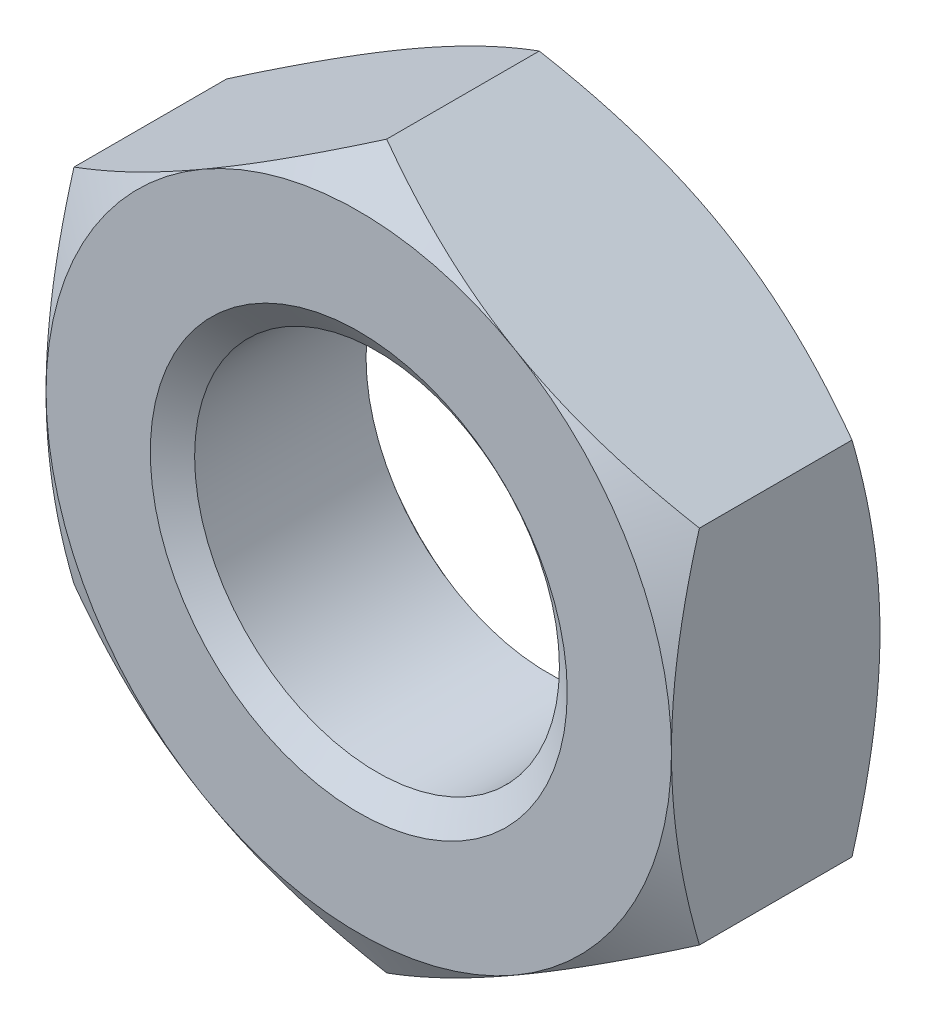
ISO-10303-21;
HEADER;
FILE_DESCRIPTION(('STEP AP214'),'2;1');
FILE_NAME('part.step','',(''),(''),'','','');
FILE_SCHEMA(('AUTOMOTIVE_DESIGN { 1 0 10303 214 1 1 1 1 }'));
ENDSEC;
DATA;
#1=APPLICATION_CONTEXT('core data for automotive mechanical design processes');
#2=APPLICATION_PROTOCOL_DEFINITION('international standard','automotive_design',2000,#1);
#3=PRODUCT_CONTEXT('',#1,'mechanical');
#4=PRODUCT('Part','Part','',(#3));
#5=PRODUCT_RELATED_PRODUCT_CATEGORY('part','',(#4));
#6=PRODUCT_DEFINITION_FORMATION('','',#4);
#7=PRODUCT_DEFINITION_CONTEXT('part definition',#1,'design');
#8=PRODUCT_DEFINITION('design','',#6,#7);
#9=PRODUCT_DEFINITION_SHAPE('','',#8);
#10=(LENGTH_UNIT() NAMED_UNIT(*) SI_UNIT(.MILLI.,.METRE.));
#11=(NAMED_UNIT(*) PLANE_ANGLE_UNIT() SI_UNIT($,.RADIAN.));
#12=(NAMED_UNIT(*) SI_UNIT($,.STERADIAN.) SOLID_ANGLE_UNIT());
#13=UNCERTAINTY_MEASURE_WITH_UNIT(LENGTH_MEASURE(1.E-05),#10,'distance_accuracy_value','');
#14=(GEOMETRIC_REPRESENTATION_CONTEXT(3) GLOBAL_UNCERTAINTY_ASSIGNED_CONTEXT((#13)) GLOBAL_UNIT_ASSIGNED_CONTEXT((#10,
#11,#12)) REPRESENTATION_CONTEXT('',''));
#15=CARTESIAN_POINT('',(0.,0.,0.));
#16=DIRECTION('',(0.,0.,1.));
#17=DIRECTION('',(1.,0.,0.));
#18=AXIS2_PLACEMENT_3D('',#15,#16,#17);
#19=CARTESIAN_POINT('',(0.,0.,-10.));
#20=DIRECTION('',(0.,0.,1.));
#21=DIRECTION('',(1.,0.,0.));
#22=AXIS2_PLACEMENT_3D('',#19,#20,#21);
#23=CYLINDRICAL_SURFACE('',#22,8.75);
#24=CARTESIAN_POINT('',(0.,0.,-0.875259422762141));
#25=DIRECTION('',(0.,0.,1.));
#26=DIRECTION('',(1.,0.,0.));
#27=AXIS2_PLACEMENT_3D('',#24,#25,#26);
#28=CIRCLE('',#27,8.75);
#29=CARTESIAN_POINT('',(8.75,0.,-0.875259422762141));
#30=VERTEX_POINT('',#29);
#31=EDGE_CURVE('E174',#30,#30,#28,.F.);
#32=ORIENTED_EDGE('',*,*,#31,.F.);
#33=EDGE_LOOP('',(#32));
#34=FACE_BOUND('',#33,.T.);
#35=CARTESIAN_POINT('',(0.,0.,-9.09934057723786));
#36=DIRECTION('',(0.,0.,-1.));
#37=DIRECTION('',(-1.,0.,0.));
#38=AXIS2_PLACEMENT_3D('',#35,#36,#37);
#39=CIRCLE('',#38,8.75);
#40=CARTESIAN_POINT('',(-8.75,0.,-9.09934057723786));
#41=VERTEX_POINT('',#40);
#42=EDGE_CURVE('E39',#41,#41,#39,.F.);
#43=ORIENTED_EDGE('',*,*,#42,.F.);
#44=EDGE_LOOP('',(#43));
#45=FACE_BOUND('',#44,.T.);
#46=ADVANCED_FACE('F34',(#34,#45),#23,.F.);
#47=CARTESIAN_POINT('',(0.,17.3205080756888,-10.));
#48=DIRECTION('',(-0.500000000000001,0.866025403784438,0.));
#49=DIRECTION('',(-0.866025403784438,-0.500000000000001,0.));
#50=AXIS2_PLACEMENT_3D('',#47,#48,#49);
#51=PLANE('',#50);
#52=DIRECTION('',(0.,0.,1.));
#53=VECTOR('',#52,1.);
#54=CARTESIAN_POINT('',(-15.,8.66025403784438,-10.));
#55=LINE('',#54,#53);
#56=CARTESIAN_POINT('',(-15.,8.66025403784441,-8.66025403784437));
#57=VERTEX_POINT('',#56);
#58=CARTESIAN_POINT('',(-15.,8.66025403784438,-1.33974596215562));
#59=VERTEX_POINT('',#58);
#60=EDGE_CURVE('E164',#57,#59,#55,.T.);
#61=ORIENTED_EDGE('',*,*,#60,.T.);
#62=CARTESIAN_POINT('',(-15.0002,8.66013856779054,-1.33981262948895));
#63=CARTESIAN_POINT('',(-14.6705058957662,8.85048754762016,-1.22992178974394));
#64=CARTESIAN_POINT('',(-14.3395258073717,9.04157899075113,-1.12501758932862));
#65=CARTESIAN_POINT('',(-13.674911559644,9.42529420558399,-0.926568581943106));
#66=CARTESIAN_POINT('',(-13.3412765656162,9.61791845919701,-0.833027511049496));
#67=CARTESIAN_POINT('',(-12.6707077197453,10.0050715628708,-0.658562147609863));
#68=CARTESIAN_POINT('',(-12.333767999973,10.199603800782,-0.577667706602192));
#69=CARTESIAN_POINT('',(-11.6575472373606,10.5900200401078,-0.430232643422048));
#70=CARTESIAN_POINT('',(-11.3182663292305,10.7859039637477,-0.363691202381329));
#71=CARTESIAN_POINT('',(-10.6460568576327,11.1740042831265,-0.24779237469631));
#72=CARTESIAN_POINT('',(-10.3131781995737,11.3661918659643,-0.198051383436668));
#73=CARTESIAN_POINT('',(-9.6458955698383,11.7514476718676,-0.11464674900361));
#74=CARTESIAN_POINT('',(-9.3114915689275,11.9445159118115,-0.0809834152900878));
#75=CARTESIAN_POINT('',(-8.64212181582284,12.3309767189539,-0.0305840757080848));
#76=CARTESIAN_POINT('',(-8.30715720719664,12.5243686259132,-0.0138279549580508));
#77=CARTESIAN_POINT('',(-7.63691878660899,12.9113309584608,0.00239660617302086));
#78=CARTESIAN_POINT('',(-7.30164498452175,13.1049013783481,0.00186558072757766));
#79=CARTESIAN_POINT('',(-6.67485311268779,13.4667798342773,-0.01527661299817));
#80=CARTESIAN_POINT('',(-6.38329037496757,13.6351136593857,-0.0297968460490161));
#81=CARTESIAN_POINT('',(-5.80083556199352,13.9713941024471,-0.0716371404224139));
#82=CARTESIAN_POINT('',(-5.50994353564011,14.1393406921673,-0.0989581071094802));
#83=CARTESIAN_POINT('',(-4.92898814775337,14.4747554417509,-0.16592351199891));
#84=CARTESIAN_POINT('',(-4.63892567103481,14.6422230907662,-0.205578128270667));
#85=CARTESIAN_POINT('',(-4.06016058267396,14.9763732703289,-0.29651510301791));
#86=CARTESIAN_POINT('',(-3.77145806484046,15.1430557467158,-0.347798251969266));
#87=CARTESIAN_POINT('',(-2.89508556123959,15.6490296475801,-0.520386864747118));
#88=CARTESIAN_POINT('',(-2.30995340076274,15.9868558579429,-0.658901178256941));
#89=CARTESIAN_POINT('',(-1.14841408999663,16.6574708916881,-0.973271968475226));
#90=CARTESIAN_POINT('',(-0.57199206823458,16.9902683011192,-1.14905461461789));
#91=CARTESIAN_POINT('',(0.000200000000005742,17.3206235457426,-1.33981262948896));
#92=B_SPLINE_CURVE_WITH_KNOTS('',3,(#62,#63,#64,#65,#66,#67,#68,#69,#70,#71,#72,#73,#74,#75,#76,
#77,#78,#79,#80,#81,#82,#83,#84,#85,#86,#87,#88,#89,#90,#91),.UNSPECIFIED.,.F.,.F.,(4,2,2,2,2,2,
2,2,2,2,2,2,2,2,4),(0.,1.18875411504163,2.37789802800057,3.56980778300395,4.76164951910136,
5.92407379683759,7.08652044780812,8.24758247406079,9.40860862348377,10.4193068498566,
11.4300765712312,12.4416826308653,13.4533574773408,15.5211962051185,17.5849760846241),.UNSPECIFIED.);
#93=CARTESIAN_POINT('',(-7.50000000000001,12.9903810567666,0.));
#94=VERTEX_POINT('',#93);
#95=EDGE_CURVE('E133',#59,#94,#92,.T.);
#96=ORIENTED_EDGE('',*,*,#95,.T.);
#97=CARTESIAN_POINT('',(0.,17.3205080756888,-1.33974596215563));
#98=VERTEX_POINT('',#97);
#99=EDGE_CURVE('E53',#94,#98,#92,.T.);
#100=ORIENTED_EDGE('',*,*,#99,.T.);
#101=DIRECTION('',(0.,0.,1.));
#102=VECTOR('',#101,1.);
#103=CARTESIAN_POINT('',(0.,17.3205080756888,-10.));
#104=LINE('',#103,#102);
#105=CARTESIAN_POINT('',(0.,17.3205080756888,-8.66025403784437));
#106=VERTEX_POINT('',#105);
#107=EDGE_CURVE('E149',#106,#98,#104,.T.);
#108=ORIENTED_EDGE('',*,*,#107,.F.);
#109=CARTESIAN_POINT('',(-15.0002,8.66013856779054,-8.66018737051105));
#110=CARTESIAN_POINT('',(-14.6705058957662,8.85048754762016,-8.77007821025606));
#111=CARTESIAN_POINT('',(-14.3395258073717,9.04157899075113,-8.87498241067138));
#112=CARTESIAN_POINT('',(-13.674911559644,9.42529420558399,-9.07343141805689));
#113=CARTESIAN_POINT('',(-13.3412765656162,9.61791845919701,-9.1669724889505));
#114=CARTESIAN_POINT('',(-12.6707077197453,10.0050715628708,-9.34143785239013));
#115=CARTESIAN_POINT('',(-12.333767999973,10.199603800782,-9.42233229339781));
#116=CARTESIAN_POINT('',(-11.6575472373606,10.5900200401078,-9.56976735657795));
#117=CARTESIAN_POINT('',(-11.3182663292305,10.7859039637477,-9.63630879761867));
#118=CARTESIAN_POINT('',(-10.6460568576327,11.1740042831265,-9.75220762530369));
#119=CARTESIAN_POINT('',(-10.3131781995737,11.3661918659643,-9.80194861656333));
#120=CARTESIAN_POINT('',(-9.6458955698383,11.7514476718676,-9.88535325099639));
#121=CARTESIAN_POINT('',(-9.3114915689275,11.9445159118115,-9.91901658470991));
#122=CARTESIAN_POINT('',(-8.64212181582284,12.3309767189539,-9.96941592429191));
#123=CARTESIAN_POINT('',(-8.30715720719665,12.5243686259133,-9.98617204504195));
#124=CARTESIAN_POINT('',(-7.63691878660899,12.9113309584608,-10.002396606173));
#125=CARTESIAN_POINT('',(-7.30164498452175,13.1049013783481,-10.0018655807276));
#126=CARTESIAN_POINT('',(-6.67485311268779,13.4667798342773,-9.98472338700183));
#127=CARTESIAN_POINT('',(-6.38329037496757,13.6351136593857,-9.97020315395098));
#128=CARTESIAN_POINT('',(-5.80083556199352,13.9713941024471,-9.92836285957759));
#129=CARTESIAN_POINT('',(-5.50994353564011,14.1393406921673,-9.90104189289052));
#130=CARTESIAN_POINT('',(-4.92898814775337,14.4747554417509,-9.83407648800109));
#131=CARTESIAN_POINT('',(-4.63892567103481,14.6422230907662,-9.79442187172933));
#132=CARTESIAN_POINT('',(-4.06016058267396,14.9763732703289,-9.70348489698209));
#133=CARTESIAN_POINT('',(-3.77145806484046,15.1430557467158,-9.65220174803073));
#134=CARTESIAN_POINT('',(-2.89508556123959,15.6490296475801,-9.47961313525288));
#135=CARTESIAN_POINT('',(-2.30995340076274,15.9868558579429,-9.34109882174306));
#136=CARTESIAN_POINT('',(-1.14841408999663,16.6574708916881,-9.02672803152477));
#137=CARTESIAN_POINT('',(-0.571992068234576,16.9902683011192,-8.85094538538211));
#138=CARTESIAN_POINT('',(0.000200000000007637,17.3206235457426,-8.66018737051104));
#139=B_SPLINE_CURVE_WITH_KNOTS('',3,(#109,#110,#111,#112,#113,#114,#115,#116,#117,#118,#119,
#120,#121,#122,#123,#124,#125,#126,#127,#128,#129,#130,#131,#132,#133,#134,#135,#136,#137,#138),
.UNSPECIFIED.,.F.,.F.,(4,2,2,2,2,2,2,2,2,2,2,2,2,2,4),(0.,1.18875411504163,2.37789802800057,
3.56980778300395,4.76164951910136,5.92407379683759,7.08652044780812,8.24758247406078,
9.40860862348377,10.4193068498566,11.4300765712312,12.4416826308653,13.4533574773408,
15.5211962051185,17.5849760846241),.UNSPECIFIED.);
#140=CARTESIAN_POINT('',(-7.50000000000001,12.9903810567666,-10.));
#141=VERTEX_POINT('',#140);
#142=EDGE_CURVE('E167',#141,#106,#139,.T.);
#143=ORIENTED_EDGE('',*,*,#142,.F.);
#144=EDGE_CURVE('E266',#57,#141,#139,.T.);
#145=ORIENTED_EDGE('',*,*,#144,.F.);
#146=EDGE_LOOP('',(#61,#96,#100,#108,#143,#145));
#147=FACE_BOUND('',#146,.T.);
#148=ADVANCED_FACE('F36',(#147),#51,.T.);
#149=CARTESIAN_POINT('',(15.,8.66025403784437,-10.));
#150=DIRECTION('',(0.500000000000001,0.866025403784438,0.));
#151=DIRECTION('',(-0.866025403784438,0.500000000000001,0.));
#152=AXIS2_PLACEMENT_3D('',#149,#150,#151);
#153=PLANE('',#152);
#154=ORIENTED_EDGE('',*,*,#107,.T.);
#155=CARTESIAN_POINT('',(-0.000199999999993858,17.3206235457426,-1.33981262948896));
#156=CARTESIAN_POINT('',(0.329494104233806,17.130274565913,-1.22992178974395));
#157=CARTESIAN_POINT('',(0.660474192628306,16.939183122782,-1.12501758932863));
#158=CARTESIAN_POINT('',(1.32508844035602,16.5554679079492,-0.926568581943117));
#159=CARTESIAN_POINT('',(1.65872343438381,16.3628436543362,-0.833027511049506));
#160=CARTESIAN_POINT('',(2.32929228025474,15.9756905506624,-0.658562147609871));
#161=CARTESIAN_POINT('',(2.66623200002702,15.7811583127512,-0.577667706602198));
#162=CARTESIAN_POINT('',(3.34245276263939,15.3907420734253,-0.430232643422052));
#163=CARTESIAN_POINT('',(3.68173367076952,15.1948581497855,-0.363691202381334));
#164=CARTESIAN_POINT('',(4.35394314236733,14.8067578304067,-0.247792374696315));
#165=CARTESIAN_POINT('',(4.68682180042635,14.6145702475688,-0.198051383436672));
#166=CARTESIAN_POINT('',(5.35410443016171,14.2293144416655,-0.114646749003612));
#167=CARTESIAN_POINT('',(5.68850843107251,14.0362462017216,-0.0809834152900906));
#168=CARTESIAN_POINT('',(6.35787818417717,13.6497853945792,-0.030584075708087));
#169=CARTESIAN_POINT('',(6.69284279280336,13.4563934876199,-0.0138279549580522));
#170=CARTESIAN_POINT('',(7.36308121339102,13.0694311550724,0.00239660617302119));
#171=CARTESIAN_POINT('',(7.69835501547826,12.8758607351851,0.00186558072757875));
#172=CARTESIAN_POINT('',(8.32514688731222,12.5139822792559,-0.0152766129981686));
#173=CARTESIAN_POINT('',(8.61670962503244,12.3456484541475,-0.0297968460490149));
#174=CARTESIAN_POINT('',(9.19916443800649,12.0093680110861,-0.0716371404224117));
#175=CARTESIAN_POINT('',(9.4900564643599,11.8414214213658,-0.0989581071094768));
#176=CARTESIAN_POINT('',(10.0710118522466,11.5060066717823,-0.165923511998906));
#177=CARTESIAN_POINT('',(10.3610743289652,11.338539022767,-0.205578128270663));
#178=CARTESIAN_POINT('',(10.939839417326,11.0043888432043,-0.296515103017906));
#179=CARTESIAN_POINT('',(11.2285419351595,10.8377063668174,-0.347798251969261));
#180=CARTESIAN_POINT('',(12.1049144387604,10.3317324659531,-0.520386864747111));
#181=CARTESIAN_POINT('',(12.6900465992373,9.99390625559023,-0.658901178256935));
#182=CARTESIAN_POINT('',(13.8515859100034,9.32329122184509,-0.973271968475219));
#183=CARTESIAN_POINT('',(14.4280079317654,8.99049381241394,-1.14905461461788));
#184=CARTESIAN_POINT('',(15.0002,8.66013856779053,-1.33981262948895));
#185=B_SPLINE_CURVE_WITH_KNOTS('',3,(#155,#156,#157,#158,#159,#160,#161,#162,#163,#164,#165,
#166,#167,#168,#169,#170,#171,#172,#173,#174,#175,#176,#177,#178,#179,#180,#181,#182,#183,#184),
.UNSPECIFIED.,.F.,.F.,(4,2,2,2,2,2,2,2,2,2,2,2,2,2,4),(0.,1.18875411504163,2.37789802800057,
3.56980778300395,4.76164951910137,5.9240737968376,7.08652044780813,8.2475824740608,
9.40860862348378,10.4193068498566,11.4300765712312,12.4416826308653,13.4533574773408,
15.5211962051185,17.5849760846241),.UNSPECIFIED.);
#186=CARTESIAN_POINT('',(7.50000000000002,12.9903810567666,0.));
#187=VERTEX_POINT('',#186);
#188=EDGE_CURVE('E143',#98,#187,#185,.T.);
#189=ORIENTED_EDGE('',*,*,#188,.T.);
#190=CARTESIAN_POINT('',(15.,8.66025403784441,-1.33974596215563));
#191=VERTEX_POINT('',#190);
#192=EDGE_CURVE('E60',#187,#191,#185,.T.);
#193=ORIENTED_EDGE('',*,*,#192,.T.);
#194=DIRECTION('',(0.,0.,1.));
#195=VECTOR('',#194,1.);
#196=CARTESIAN_POINT('',(15.,8.66025403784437,-10.));
#197=LINE('',#196,#195);
#198=CARTESIAN_POINT('',(15.,8.66025403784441,-8.66025403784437));
#199=VERTEX_POINT('',#198);
#200=EDGE_CURVE('E142',#199,#191,#197,.T.);
#201=ORIENTED_EDGE('',*,*,#200,.F.);
#202=CARTESIAN_POINT('',(-0.000199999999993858,17.3206235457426,-8.66018737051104));
#203=CARTESIAN_POINT('',(0.329494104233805,17.130274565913,-8.77007821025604));
#204=CARTESIAN_POINT('',(0.660474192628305,16.939183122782,-8.87498241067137));
#205=CARTESIAN_POINT('',(1.32508844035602,16.5554679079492,-9.07343141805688));
#206=CARTESIAN_POINT('',(1.65872343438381,16.3628436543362,-9.1669724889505));
#207=CARTESIAN_POINT('',(2.32929228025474,15.9756905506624,-9.34143785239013));
#208=CARTESIAN_POINT('',(2.66623200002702,15.7811583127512,-9.4223322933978));
#209=CARTESIAN_POINT('',(3.34245276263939,15.3907420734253,-9.56976735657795));
#210=CARTESIAN_POINT('',(3.68173367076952,15.1948581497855,-9.63630879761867));
#211=CARTESIAN_POINT('',(4.35394314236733,14.8067578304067,-9.75220762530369));
#212=CARTESIAN_POINT('',(4.68682180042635,14.6145702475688,-9.80194861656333));
#213=CARTESIAN_POINT('',(5.35410443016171,14.2293144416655,-9.88535325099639));
#214=CARTESIAN_POINT('',(5.68850843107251,14.0362462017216,-9.91901658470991));
#215=CARTESIAN_POINT('',(6.35787818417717,13.6497853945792,-9.96941592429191));
#216=CARTESIAN_POINT('',(6.69284279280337,13.4563934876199,-9.98617204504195));
#217=CARTESIAN_POINT('',(7.36308121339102,13.0694311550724,-10.002396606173));
#218=CARTESIAN_POINT('',(7.69835501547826,12.8758607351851,-10.0018655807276));
#219=CARTESIAN_POINT('',(8.32514688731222,12.5139822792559,-9.98472338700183));
#220=CARTESIAN_POINT('',(8.61670962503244,12.3456484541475,-9.97020315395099));
#221=CARTESIAN_POINT('',(9.19916443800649,12.0093680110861,-9.92836285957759));
#222=CARTESIAN_POINT('',(9.4900564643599,11.8414214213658,-9.90104189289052));
#223=CARTESIAN_POINT('',(10.0710118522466,11.5060066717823,-9.8340764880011));
#224=CARTESIAN_POINT('',(10.3610743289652,11.338539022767,-9.79442187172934));
#225=CARTESIAN_POINT('',(10.939839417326,11.0043888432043,-9.7034848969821));
#226=CARTESIAN_POINT('',(11.2285419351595,10.8377063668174,-9.65220174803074));
#227=CARTESIAN_POINT('',(12.1049144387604,10.3317324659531,-9.47961313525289));
#228=CARTESIAN_POINT('',(12.6900465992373,9.99390625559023,-9.34109882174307));
#229=CARTESIAN_POINT('',(13.8515859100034,9.32329122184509,-9.02672803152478));
#230=CARTESIAN_POINT('',(14.4280079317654,8.99049381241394,-8.85094538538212));
#231=CARTESIAN_POINT('',(15.0002,8.66013856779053,-8.66018737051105));
#232=B_SPLINE_CURVE_WITH_KNOTS('',3,(#202,#203,#204,#205,#206,#207,#208,#209,#210,#211,#212,
#213,#214,#215,#216,#217,#218,#219,#220,#221,#222,#223,#224,#225,#226,#227,#228,#229,#230,#231),
.UNSPECIFIED.,.F.,.F.,(4,2,2,2,2,2,2,2,2,2,2,2,2,2,4),(0.,1.18875411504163,2.37789802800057,
3.56980778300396,4.76164951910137,5.9240737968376,7.08652044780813,8.2475824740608,
9.40860862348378,10.4193068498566,11.4300765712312,12.4416826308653,13.4533574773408,
15.5211962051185,17.5849760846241),.UNSPECIFIED.);
#233=CARTESIAN_POINT('',(7.50000000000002,12.9903810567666,-10.));
#234=VERTEX_POINT('',#233);
#235=EDGE_CURVE('E259',#234,#199,#232,.T.);
#236=ORIENTED_EDGE('',*,*,#235,.F.);
#237=EDGE_CURVE('E265',#106,#234,#232,.T.);
#238=ORIENTED_EDGE('',*,*,#237,.F.);
#239=EDGE_LOOP('',(#154,#189,#193,#201,#236,#238));
#240=FACE_BOUND('',#239,.T.);
#241=ADVANCED_FACE('F140',(#240),#153,.T.);
#242=CARTESIAN_POINT('',(15.,8.66025403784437,-10.));
#243=DIRECTION('',(-1.,0.,0.));
#244=DIRECTION('',(0.,0.,1.));
#245=AXIS2_PLACEMENT_3D('',#242,#243,#244);
#246=PLANE('',#245);
#247=CARTESIAN_POINT('',(15.,-22.9682699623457,-7.1779005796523));
#248=CARTESIAN_POINT('',(15.,-22.6389897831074,-7.01873142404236));
#249=CARTESIAN_POINT('',(15.,-22.3093116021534,-6.86038603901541));
#250=CARTESIAN_POINT('',(15.,-21.6490751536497,-6.54553189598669));
#251=CARTESIAN_POINT('',(15.,-21.3185168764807,-6.38902315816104));
#252=CARTESIAN_POINT('',(15.,-20.3252989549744,-5.92249019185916));
#253=CARTESIAN_POINT('',(15.,-19.6612032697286,-5.61551110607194));
#254=CARTESIAN_POINT('',(15.,-18.3246226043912,-5.00989859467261));
#255=CARTESIAN_POINT('',(15.,-17.6521113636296,-4.711322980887));
#256=CARTESIAN_POINT('',(15.,-16.3015621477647,-4.12699119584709));
#257=CARTESIAN_POINT('',(15.,-15.6235244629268,-3.84123435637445));
#258=CARTESIAN_POINT('',(15.,-14.2524269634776,-3.28256457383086));
#259=CARTESIAN_POINT('',(15.,-13.5592849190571,-3.00985238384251));
#260=CARTESIAN_POINT('',(15.,-12.1648203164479,-2.48578579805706));
#261=CARTESIAN_POINT('',(15.,-11.4634968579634,-2.23443377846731));
#262=CARTESIAN_POINT('',(15.,-10.0530172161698,-1.75984469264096));
#263=CARTESIAN_POINT('',(15.,-9.34388131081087,-1.53654785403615));
#264=CARTESIAN_POINT('',(15.,-7.91545988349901,-1.12531011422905));
#265=CARTESIAN_POINT('',(15.,-7.19617764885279,-0.93735803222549));
#266=CARTESIAN_POINT('',(15.,-6.10950776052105,-0.688818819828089));
#267=CARTESIAN_POINT('',(15.,-5.74591626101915,-0.61152452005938));
#268=CARTESIAN_POINT('',(15.,-5.01631310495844,-0.469286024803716));
#269=CARTESIAN_POINT('',(15.,-4.65030150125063,-0.404341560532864));
#270=CARTESIAN_POINT('',(15.,-3.91609659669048,-0.28795299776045));
#271=CARTESIAN_POINT('',(15.,-3.54790312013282,-0.236510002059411));
#272=CARTESIAN_POINT('',(15.,-2.80977894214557,-0.14816121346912));
#273=CARTESIAN_POINT('',(15.,-2.4398483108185,-0.111254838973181));
#274=CARTESIAN_POINT('',(15.,-1.70111543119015,-0.0529692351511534));
#275=CARTESIAN_POINT('',(15.,-1.33232087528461,-0.0314931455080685));
#276=CARTESIAN_POINT('',(15.,-0.594154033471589,-0.00418216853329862));
#277=CARTESIAN_POINT('',(15.,-0.224781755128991,0.00165292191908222));
#278=CARTESIAN_POINT('',(15.,0.513772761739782,-0.00245653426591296));
#279=CARTESIAN_POINT('',(15.,0.882955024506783,-0.0123966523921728));
#280=CARTESIAN_POINT('',(15.,1.62057875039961,-0.0478095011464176));
#281=CARTESIAN_POINT('',(15.,1.98902017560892,-0.0732830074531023));
#282=CARTESIAN_POINT('',(15.,2.8820087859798,-0.153315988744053));
#283=CARTESIAN_POINT('',(15.,3.40586988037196,-0.215658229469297));
#284=CARTESIAN_POINT('',(15.,4.44957771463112,-0.36828432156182));
#285=CARTESIAN_POINT('',(15.,4.96942331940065,-0.4585757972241));
#286=CARTESIAN_POINT('',(15.,6.00467140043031,-0.663898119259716));
#287=CARTESIAN_POINT('',(15.,6.52006919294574,-0.778952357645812));
#288=CARTESIAN_POINT('',(15.,7.54556200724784,-1.030289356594));
#289=CARTESIAN_POINT('',(15.,8.05565752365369,-1.1665701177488));
#290=CARTESIAN_POINT('',(15.,9.08310964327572,-1.46066370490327));
#291=CARTESIAN_POINT('',(15.,9.60033774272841,-1.61892244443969));
#292=CARTESIAN_POINT('',(15.,10.6293258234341,-1.95107200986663));
#293=CARTESIAN_POINT('',(15.,11.1410893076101,-2.12495205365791));
#294=CARTESIAN_POINT('',(15.,12.1570993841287,-2.48477464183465));
#295=CARTESIAN_POINT('',(15.,12.6613720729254,-2.67064378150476));
#296=CARTESIAN_POINT('',(15.,13.4147912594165,-2.95756327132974));
#297=CARTESIAN_POINT('',(15.,13.665486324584,-3.05457748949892));
#298=CARTESIAN_POINT('',(15.,14.1659013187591,-3.2510732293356));
#299=CARTESIAN_POINT('',(15.,14.4156212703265,-3.35055469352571));
#300=CARTESIAN_POINT('',(15.,14.6648887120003,-3.4511587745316));
#301=B_SPLINE_CURVE_WITH_KNOTS('',3,(#247,#248,#249,#250,#251,#252,#253,#254,#255,#256,#257,
#258,#259,#260,#261,#262,#263,#264,#265,#266,#267,#268,#269,#270,#271,#272,#273,#274,#275,#276,
#277,#278,#279,#280,#281,#282,#283,#284,#285,#286,#287,#288,#289,#290,#291,#292,#293,#294,#295,
#296,#297,#298,#299,#300),.UNSPECIFIED.,.F.,.F.,(4,2,2,2,2,2,2,2,2,2,2,2,2,2,2,2,2,2,2,2,2,2,2,
2,2,2,4),(0.,1.09719534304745,2.19440272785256,4.38917437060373,6.59650580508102,
8.80372204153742,11.0380360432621,13.2725982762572,15.502315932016,17.7313270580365,
18.8463006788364,19.9612500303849,21.0762904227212,22.1912861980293,23.2992201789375,
24.4071397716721,25.5147483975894,26.6224123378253,28.2042036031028,29.7864267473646,
31.3701511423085,32.9537264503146,34.5761185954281,36.1973994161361,37.8095545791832,
38.6159794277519,39.4223855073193),.UNSPECIFIED.);
#302=CARTESIAN_POINT('',(15.,-8.66025403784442,-1.33974596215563));
#303=VERTEX_POINT('',#302);
#304=CARTESIAN_POINT('',(15.,0.,0.));
#305=VERTEX_POINT('',#304);
#306=EDGE_CURVE('E135',#303,#305,#301,.T.);
#307=ORIENTED_EDGE('',*,*,#306,.F.);
#308=DIRECTION('',(0.,0.,1.));
#309=VECTOR('',#308,1.);
#310=CARTESIAN_POINT('',(15.,-8.66025403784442,-10.));
#311=LINE('',#310,#309);
#312=CARTESIAN_POINT('',(15.,-8.66025403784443,-8.66025403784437));
#313=VERTEX_POINT('',#312);
#314=EDGE_CURVE('E150',#313,#303,#311,.T.);
#315=ORIENTED_EDGE('',*,*,#314,.F.);
#316=CARTESIAN_POINT('',(15.,-22.9682699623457,-2.8220994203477));
#317=CARTESIAN_POINT('',(15.,-22.6389897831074,-2.98126857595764));
#318=CARTESIAN_POINT('',(15.,-22.3093116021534,-3.13961396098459));
#319=CARTESIAN_POINT('',(15.,-21.6490751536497,-3.45446810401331));
#320=CARTESIAN_POINT('',(15.,-21.3185168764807,-3.61097684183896));
#321=CARTESIAN_POINT('',(15.,-20.3252989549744,-4.07750980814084));
#322=CARTESIAN_POINT('',(15.,-19.6612032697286,-4.38448889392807));
#323=CARTESIAN_POINT('',(15.,-18.3246226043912,-4.99010140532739));
#324=CARTESIAN_POINT('',(15.,-17.6521113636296,-5.288677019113));
#325=CARTESIAN_POINT('',(15.,-16.3015621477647,-5.8730088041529));
#326=CARTESIAN_POINT('',(15.,-15.6235244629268,-6.15876564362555));
#327=CARTESIAN_POINT('',(15.,-14.2524269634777,-6.71743542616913));
#328=CARTESIAN_POINT('',(15.,-13.5592849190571,-6.99014761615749));
#329=CARTESIAN_POINT('',(15.,-12.1648203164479,-7.51421420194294));
#330=CARTESIAN_POINT('',(15.,-11.4634968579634,-7.76556622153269));
#331=CARTESIAN_POINT('',(15.,-10.0530172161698,-8.24015530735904));
#332=CARTESIAN_POINT('',(15.,-9.34388131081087,-8.46345214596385));
#333=CARTESIAN_POINT('',(15.,-7.91545988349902,-8.87468988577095));
#334=CARTESIAN_POINT('',(15.,-7.19617764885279,-9.06264196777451));
#335=CARTESIAN_POINT('',(15.,-6.10950776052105,-9.31118118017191));
#336=CARTESIAN_POINT('',(15.,-5.74591626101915,-9.38847547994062));
#337=CARTESIAN_POINT('',(15.,-5.01631310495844,-9.53071397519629));
#338=CARTESIAN_POINT('',(15.,-4.65030150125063,-9.59565843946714));
#339=CARTESIAN_POINT('',(15.,-3.91609659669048,-9.71204700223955));
#340=CARTESIAN_POINT('',(15.,-3.54790312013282,-9.76348999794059));
#341=CARTESIAN_POINT('',(15.,-2.80977894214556,-9.85183878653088));
#342=CARTESIAN_POINT('',(15.,-2.4398483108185,-9.88874516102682));
#343=CARTESIAN_POINT('',(15.,-1.70111543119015,-9.94703076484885));
#344=CARTESIAN_POINT('',(15.,-1.33232087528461,-9.96850685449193));
#345=CARTESIAN_POINT('',(15.,-0.594154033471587,-9.9958178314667));
#346=CARTESIAN_POINT('',(15.,-0.224781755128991,-10.0016529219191));
#347=CARTESIAN_POINT('',(15.,0.513772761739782,-9.99754346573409));
#348=CARTESIAN_POINT('',(15.,0.882955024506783,-9.98760334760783));
#349=CARTESIAN_POINT('',(15.,1.62057875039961,-9.95219049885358));
#350=CARTESIAN_POINT('',(15.,1.98902017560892,-9.9267169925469));
#351=CARTESIAN_POINT('',(15.,2.8820087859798,-9.84668401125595));
#352=CARTESIAN_POINT('',(15.,3.40586988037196,-9.7843417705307));
#353=CARTESIAN_POINT('',(15.,4.44957771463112,-9.63171567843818));
#354=CARTESIAN_POINT('',(15.,4.96942331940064,-9.5414242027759));
#355=CARTESIAN_POINT('',(15.,6.0046714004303,-9.33610188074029));
#356=CARTESIAN_POINT('',(15.,6.52006919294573,-9.22104764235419));
#357=CARTESIAN_POINT('',(15.,7.54556200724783,-8.969710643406));
#358=CARTESIAN_POINT('',(15.,8.05565752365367,-8.8334298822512));
#359=CARTESIAN_POINT('',(15.,9.08310964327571,-8.53933629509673));
#360=CARTESIAN_POINT('',(15.,9.6003377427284,-8.38107755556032));
#361=CARTESIAN_POINT('',(15.,10.6293258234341,-8.04892799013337));
#362=CARTESIAN_POINT('',(15.,11.1410893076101,-7.87504794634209));
#363=CARTESIAN_POINT('',(15.,12.1570993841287,-7.51522535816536));
#364=CARTESIAN_POINT('',(15.,12.6613720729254,-7.32935621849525));
#365=CARTESIAN_POINT('',(15.,13.4147912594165,-7.04243672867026));
#366=CARTESIAN_POINT('',(15.,13.665486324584,-6.94542251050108));
#367=CARTESIAN_POINT('',(15.,14.1659013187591,-6.7489267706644));
#368=CARTESIAN_POINT('',(15.,14.4156212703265,-6.64944530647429));
#369=CARTESIAN_POINT('',(15.,14.6648887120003,-6.5488412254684));
#370=B_SPLINE_CURVE_WITH_KNOTS('',3,(#316,#317,#318,#319,#320,#321,#322,#323,#324,#325,#326,
#327,#328,#329,#330,#331,#332,#333,#334,#335,#336,#337,#338,#339,#340,#341,#342,#343,#344,#345,
#346,#347,#348,#349,#350,#351,#352,#353,#354,#355,#356,#357,#358,#359,#360,#361,#362,#363,#364,
#365,#366,#367,#368,#369),.UNSPECIFIED.,.F.,.F.,(4,2,2,2,2,2,2,2,2,2,2,2,2,2,2,2,2,2,2,2,2,2,2,
2,2,2,4),(0.,1.09719534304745,2.19440272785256,4.38917437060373,6.59650580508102,
8.80372204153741,11.0380360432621,13.2725982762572,15.502315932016,17.7313270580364,
18.8463006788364,19.9612500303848,21.0762904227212,22.1912861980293,23.2992201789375,
24.4071397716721,25.5147483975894,26.6224123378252,28.2042036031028,29.7864267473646,
31.3701511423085,32.9537264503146,34.5761185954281,36.1973994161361,37.8095545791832,
38.615979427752,39.4223855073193),.UNSPECIFIED.);
#371=CARTESIAN_POINT('',(15.,0.,-10.));
#372=VERTEX_POINT('',#371);
#373=EDGE_CURVE('E273',#313,#372,#370,.T.);
#374=ORIENTED_EDGE('',*,*,#373,.T.);
#375=EDGE_CURVE('E148',#372,#199,#370,.T.);
#376=ORIENTED_EDGE('',*,*,#375,.T.);
#377=ORIENTED_EDGE('',*,*,#200,.T.);
#378=EDGE_CURVE('E125',#305,#191,#301,.T.);
#379=ORIENTED_EDGE('',*,*,#378,.F.);
#380=EDGE_LOOP('',(#307,#315,#374,#376,#377,#379));
#381=FACE_BOUND('',#380,.T.);
#382=ADVANCED_FACE('F146',(#381),#246,.F.);
#383=CARTESIAN_POINT('',(0.,-17.3205080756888,-10.));
#384=DIRECTION('',(0.500000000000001,-0.866025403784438,0.));
#385=DIRECTION('',(0.866025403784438,0.500000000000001,0.));
#386=AXIS2_PLACEMENT_3D('',#383,#384,#385);
#387=PLANE('',#386);
#388=ORIENTED_EDGE('',*,*,#314,.T.);
#389=CARTESIAN_POINT('',(15.0002,-8.66013856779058,-1.33981262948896));
#390=CARTESIAN_POINT('',(14.6705058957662,-8.8504875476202,-1.22992178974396));
#391=CARTESIAN_POINT('',(14.3395258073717,-9.04157899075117,-1.12501758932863));
#392=CARTESIAN_POINT('',(13.674911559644,-9.42529420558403,-0.926568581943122));
#393=CARTESIAN_POINT('',(13.3412765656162,-9.61791845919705,-0.833027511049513));
#394=CARTESIAN_POINT('',(12.6707077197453,-10.0050715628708,-0.658562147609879));
#395=CARTESIAN_POINT('',(12.333767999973,-10.199603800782,-0.577667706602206));
#396=CARTESIAN_POINT('',(11.6575472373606,-10.5900200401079,-0.430232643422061));
#397=CARTESIAN_POINT('',(11.3182663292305,-10.7859039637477,-0.363691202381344));
#398=CARTESIAN_POINT('',(10.6460568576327,-11.1740042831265,-0.247792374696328));
#399=CARTESIAN_POINT('',(10.3131781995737,-11.3661918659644,-0.198051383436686));
#400=CARTESIAN_POINT('',(9.6458955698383,-11.7514476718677,-0.114646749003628));
#401=CARTESIAN_POINT('',(9.3114915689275,-11.9445159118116,-0.0809834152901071));
#402=CARTESIAN_POINT('',(8.64212181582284,-12.330976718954,-0.0305840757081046));
#403=CARTESIAN_POINT('',(8.30715720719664,-12.5243686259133,-0.0138279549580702));
#404=CARTESIAN_POINT('',(7.63691878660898,-12.9113309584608,0.00239660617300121));
#405=CARTESIAN_POINT('',(7.30164498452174,-13.1049013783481,0.00186558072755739));
#406=CARTESIAN_POINT('',(6.67485311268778,-13.4667798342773,-0.0152766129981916));
#407=CARTESIAN_POINT('',(6.38329037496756,-13.6351136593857,-0.0297968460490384));
#408=CARTESIAN_POINT('',(5.80083556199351,-13.9713941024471,-0.0716371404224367));
#409=CARTESIAN_POINT('',(5.5099435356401,-14.1393406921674,-0.0989581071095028));
#410=CARTESIAN_POINT('',(4.92898814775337,-14.4747554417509,-0.165923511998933));
#411=CARTESIAN_POINT('',(4.63892567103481,-14.6422230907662,-0.205578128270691));
#412=CARTESIAN_POINT('',(4.06016058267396,-14.9763732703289,-0.296515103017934));
#413=CARTESIAN_POINT('',(3.77145806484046,-15.1430557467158,-0.347798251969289));
#414=CARTESIAN_POINT('',(2.89508556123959,-15.6490296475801,-0.52038686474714));
#415=CARTESIAN_POINT('',(2.30995340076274,-15.986855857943,-0.658901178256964));
#416=CARTESIAN_POINT('',(1.14841408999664,-16.6574708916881,-0.97327196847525));
#417=CARTESIAN_POINT('',(0.571992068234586,-16.9902683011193,-1.14905461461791));
#418=CARTESIAN_POINT('',(-0.000199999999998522,-17.3206235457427,-1.33981262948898));
#419=B_SPLINE_CURVE_WITH_KNOTS('',3,(#389,#390,#391,#392,#393,#394,#395,#396,#397,#398,#399,
#400,#401,#402,#403,#404,#405,#406,#407,#408,#409,#410,#411,#412,#413,#414,#415,#416,#417,#418),
.UNSPECIFIED.,.F.,.F.,(4,2,2,2,2,2,2,2,2,2,2,2,2,2,4),(0.,1.18875411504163,2.37789802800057,
3.56980778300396,4.76164951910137,5.9240737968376,7.08652044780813,8.2475824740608,
9.40860862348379,10.4193068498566,11.4300765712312,12.4416826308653,13.4533574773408,
15.5211962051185,17.5849760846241),.UNSPECIFIED.);
#420=CARTESIAN_POINT('',(7.50000000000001,-12.9903810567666,0.));
#421=VERTEX_POINT('',#420);
#422=EDGE_CURVE('E371',#303,#421,#419,.T.);
#423=ORIENTED_EDGE('',*,*,#422,.T.);
#424=CARTESIAN_POINT('',(0.,-17.3205080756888,-1.33974596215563));
#425=VERTEX_POINT('',#424);
#426=EDGE_CURVE('E227',#421,#425,#419,.T.);
#427=ORIENTED_EDGE('',*,*,#426,.T.);
#428=DIRECTION('',(0.,0.,1.));
#429=VECTOR('',#428,1.);
#430=CARTESIAN_POINT('',(0.,-17.3205080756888,-10.));
#431=LINE('',#430,#429);
#432=CARTESIAN_POINT('',(0.,-17.3205080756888,-8.66025403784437));
#433=VERTEX_POINT('',#432);
#434=EDGE_CURVE('E155',#433,#425,#431,.T.);
#435=ORIENTED_EDGE('',*,*,#434,.F.);
#436=CARTESIAN_POINT('',(15.0002,-8.66013856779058,-8.66018737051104));
#437=CARTESIAN_POINT('',(14.6705058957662,-8.8504875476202,-8.77007821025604));
#438=CARTESIAN_POINT('',(14.3395258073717,-9.04157899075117,-8.87498241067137));
#439=CARTESIAN_POINT('',(13.674911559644,-9.42529420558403,-9.07343141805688));
#440=CARTESIAN_POINT('',(13.3412765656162,-9.61791845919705,-9.16697248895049));
#441=CARTESIAN_POINT('',(12.6707077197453,-10.0050715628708,-9.34143785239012));
#442=CARTESIAN_POINT('',(12.333767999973,-10.199603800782,-9.42233229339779));
#443=CARTESIAN_POINT('',(11.6575472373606,-10.5900200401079,-9.56976735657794));
#444=CARTESIAN_POINT('',(11.3182663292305,-10.7859039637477,-9.63630879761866));
#445=CARTESIAN_POINT('',(10.6460568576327,-11.1740042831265,-9.75220762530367));
#446=CARTESIAN_POINT('',(10.3131781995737,-11.3661918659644,-9.80194861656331));
#447=CARTESIAN_POINT('',(9.6458955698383,-11.7514476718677,-9.88535325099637));
#448=CARTESIAN_POINT('',(9.3114915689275,-11.9445159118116,-9.91901658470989));
#449=CARTESIAN_POINT('',(8.64212181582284,-12.330976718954,-9.9694159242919));
#450=CARTESIAN_POINT('',(8.30715720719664,-12.5243686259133,-9.98617204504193));
#451=CARTESIAN_POINT('',(7.63691878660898,-12.9113309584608,-10.002396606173));
#452=CARTESIAN_POINT('',(7.30164498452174,-13.1049013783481,-10.0018655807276));
#453=CARTESIAN_POINT('',(6.67485311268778,-13.4667798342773,-9.98472338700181));
#454=CARTESIAN_POINT('',(6.38329037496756,-13.6351136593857,-9.97020315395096));
#455=CARTESIAN_POINT('',(5.80083556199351,-13.9713941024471,-9.92836285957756));
#456=CARTESIAN_POINT('',(5.5099435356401,-14.1393406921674,-9.9010418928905));
#457=CARTESIAN_POINT('',(4.92898814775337,-14.4747554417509,-9.83407648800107));
#458=CARTESIAN_POINT('',(4.63892567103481,-14.6422230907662,-9.79442187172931));
#459=CARTESIAN_POINT('',(4.06016058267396,-14.9763732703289,-9.70348489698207));
#460=CARTESIAN_POINT('',(3.77145806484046,-15.1430557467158,-9.65220174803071));
#461=CARTESIAN_POINT('',(2.89508556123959,-15.6490296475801,-9.47961313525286));
#462=CARTESIAN_POINT('',(2.30995340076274,-15.986855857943,-9.34109882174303));
#463=CARTESIAN_POINT('',(1.14841408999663,-16.6574708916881,-9.02672803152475));
#464=CARTESIAN_POINT('',(0.571992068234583,-16.9902683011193,-8.85094538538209));
#465=CARTESIAN_POINT('',(-0.000200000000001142,-17.3206235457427,-8.66018737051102));
#466=B_SPLINE_CURVE_WITH_KNOTS('',3,(#436,#437,#438,#439,#440,#441,#442,#443,#444,#445,#446,
#447,#448,#449,#450,#451,#452,#453,#454,#455,#456,#457,#458,#459,#460,#461,#462,#463,#464,#465),
.UNSPECIFIED.,.F.,.F.,(4,2,2,2,2,2,2,2,2,2,2,2,2,2,4),(0.,1.18875411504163,2.37789802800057,
3.56980778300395,4.76164951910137,5.9240737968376,7.08652044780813,8.2475824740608,
9.40860862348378,10.4193068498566,11.4300765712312,12.4416826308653,13.4533574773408,
15.5211962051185,17.5849760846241),.UNSPECIFIED.);
#467=CARTESIAN_POINT('',(7.50000000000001,-12.9903810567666,-10.));
#468=VERTEX_POINT('',#467);
#469=EDGE_CURVE('E280',#468,#433,#466,.T.);
#470=ORIENTED_EDGE('',*,*,#469,.F.);
#471=EDGE_CURVE('E279',#313,#468,#466,.T.);
#472=ORIENTED_EDGE('',*,*,#471,.F.);
#473=EDGE_LOOP('',(#388,#423,#427,#435,#470,#472));
#474=FACE_BOUND('',#473,.T.);
#475=ADVANCED_FACE('F292',(#474),#387,.T.);
#476=CARTESIAN_POINT('',(-15.,-8.66025403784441,-10.));
#477=DIRECTION('',(-0.500000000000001,-0.866025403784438,0.));
#478=DIRECTION('',(0.866025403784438,-0.500000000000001,0.));
#479=AXIS2_PLACEMENT_3D('',#476,#477,#478);
#480=PLANE('',#479);
#481=ORIENTED_EDGE('',*,*,#434,.T.);
#482=CARTESIAN_POINT('',(0.000199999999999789,-17.3206235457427,-1.33981262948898));
#483=CARTESIAN_POINT('',(-0.3294941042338,-17.130274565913,-1.22992178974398));
#484=CARTESIAN_POINT('',(-0.660474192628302,-16.9391831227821,-1.12501758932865));
#485=CARTESIAN_POINT('',(-1.32508844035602,-16.5554679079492,-0.926568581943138));
#486=CARTESIAN_POINT('',(-1.65872343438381,-16.3628436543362,-0.833027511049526));
#487=CARTESIAN_POINT('',(-2.32929228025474,-15.9756905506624,-0.658562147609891));
#488=CARTESIAN_POINT('',(-2.66623200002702,-15.7811583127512,-0.577667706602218));
#489=CARTESIAN_POINT('',(-3.34245276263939,-15.3907420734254,-0.430232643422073));
#490=CARTESIAN_POINT('',(-3.68173367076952,-15.1948581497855,-0.363691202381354));
#491=CARTESIAN_POINT('',(-4.35394314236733,-14.8067578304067,-0.247792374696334));
#492=CARTESIAN_POINT('',(-4.68682180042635,-14.6145702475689,-0.198051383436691));
#493=CARTESIAN_POINT('',(-5.35410443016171,-14.2293144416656,-0.114646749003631));
#494=CARTESIAN_POINT('',(-5.68850843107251,-14.0362462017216,-0.0809834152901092));
#495=CARTESIAN_POINT('',(-6.35787818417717,-13.6497853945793,-0.0305840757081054));
#496=CARTESIAN_POINT('',(-6.69284279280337,-13.4563934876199,-0.0138279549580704));
#497=CARTESIAN_POINT('',(-7.36308121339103,-13.0694311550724,0.00239660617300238));
#498=CARTESIAN_POINT('',(-7.69835501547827,-12.8758607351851,0.00186558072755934));
#499=CARTESIAN_POINT('',(-8.32514688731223,-12.5139822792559,-0.0152766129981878));
#500=CARTESIAN_POINT('',(-8.61670962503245,-12.3456484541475,-0.0297968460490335));
#501=CARTESIAN_POINT('',(-9.1991644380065,-12.0093680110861,-0.0716371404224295));
#502=CARTESIAN_POINT('',(-9.49005646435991,-11.8414214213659,-0.0989581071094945));
#503=CARTESIAN_POINT('',(-10.0710118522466,-11.5060066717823,-0.165923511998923));
#504=CARTESIAN_POINT('',(-10.3610743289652,-11.338539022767,-0.20557812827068));
#505=CARTESIAN_POINT('',(-10.939839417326,-11.0043888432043,-0.296515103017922));
#506=CARTESIAN_POINT('',(-11.2285419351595,-10.8377063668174,-0.347798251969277));
#507=CARTESIAN_POINT('',(-12.1049144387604,-10.3317324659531,-0.520386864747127));
#508=CARTESIAN_POINT('',(-12.6900465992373,-9.99390625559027,-0.658901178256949));
#509=CARTESIAN_POINT('',(-13.8515859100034,-9.32329122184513,-0.973271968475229));
#510=CARTESIAN_POINT('',(-14.4280079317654,-8.99049381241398,-1.14905461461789));
#511=CARTESIAN_POINT('',(-15.0002,-8.66013856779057,-1.33981262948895));
#512=B_SPLINE_CURVE_WITH_KNOTS('',3,(#482,#483,#484,#485,#486,#487,#488,#489,#490,#491,#492,
#493,#494,#495,#496,#497,#498,#499,#500,#501,#502,#503,#504,#505,#506,#507,#508,#509,#510,#511),
.UNSPECIFIED.,.F.,.F.,(4,2,2,2,2,2,2,2,2,2,2,2,2,2,4),(0.,1.18875411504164,2.37789802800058,
3.56980778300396,4.76164951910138,5.92407379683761,7.08652044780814,8.24758247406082,
9.4086086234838,10.4193068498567,11.4300765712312,12.4416826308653,13.4533574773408,
15.5211962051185,17.5849760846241),.UNSPECIFIED.);
#513=CARTESIAN_POINT('',(-7.50000000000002,-12.9903810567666,0.));
#514=VERTEX_POINT('',#513);
#515=EDGE_CURVE('E368',#425,#514,#512,.T.);
#516=ORIENTED_EDGE('',*,*,#515,.T.);
#517=CARTESIAN_POINT('',(-15.,-8.66025403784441,-1.33974596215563));
#518=VERTEX_POINT('',#517);
#519=EDGE_CURVE('E200',#514,#518,#512,.T.);
#520=ORIENTED_EDGE('',*,*,#519,.T.);
#521=DIRECTION('',(0.,0.,1.));
#522=VECTOR('',#521,1.);
#523=CARTESIAN_POINT('',(-15.,-8.66025403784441,-10.));
#524=LINE('',#523,#522);
#525=CARTESIAN_POINT('',(-15.,-8.66025403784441,-8.66025403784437));
#526=VERTEX_POINT('',#525);
#527=EDGE_CURVE('E161',#526,#518,#524,.T.);
#528=ORIENTED_EDGE('',*,*,#527,.F.);
#529=CARTESIAN_POINT('',(0.000199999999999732,-17.3206235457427,-8.66018737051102));
#530=CARTESIAN_POINT('',(-0.3294941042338,-17.130274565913,-8.77007821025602));
#531=CARTESIAN_POINT('',(-0.660474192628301,-16.9391831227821,-8.87498241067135));
#532=CARTESIAN_POINT('',(-1.32508844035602,-16.5554679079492,-9.07343141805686));
#533=CARTESIAN_POINT('',(-1.65872343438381,-16.3628436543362,-9.16697248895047));
#534=CARTESIAN_POINT('',(-2.32929228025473,-15.9756905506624,-9.34143785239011));
#535=CARTESIAN_POINT('',(-2.66623200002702,-15.7811583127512,-9.42233229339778));
#536=CARTESIAN_POINT('',(-3.34245276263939,-15.3907420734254,-9.56976735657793));
#537=CARTESIAN_POINT('',(-3.68173367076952,-15.1948581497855,-9.63630879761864));
#538=CARTESIAN_POINT('',(-4.35394314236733,-14.8067578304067,-9.75220762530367));
#539=CARTESIAN_POINT('',(-4.68682180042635,-14.6145702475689,-9.80194861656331));
#540=CARTESIAN_POINT('',(-5.35410443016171,-14.2293144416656,-9.88535325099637));
#541=CARTESIAN_POINT('',(-5.68850843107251,-14.0362462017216,-9.91901658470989));
#542=CARTESIAN_POINT('',(-6.35787818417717,-13.6497853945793,-9.96941592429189));
#543=CARTESIAN_POINT('',(-6.69284279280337,-13.4563934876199,-9.98617204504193));
#544=CARTESIAN_POINT('',(-7.36308121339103,-13.0694311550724,-10.002396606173));
#545=CARTESIAN_POINT('',(-7.69835501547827,-12.8758607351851,-10.0018655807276));
#546=CARTESIAN_POINT('',(-8.32514688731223,-12.5139822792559,-9.98472338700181));
#547=CARTESIAN_POINT('',(-8.61670962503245,-12.3456484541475,-9.97020315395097));
#548=CARTESIAN_POINT('',(-9.1991644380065,-12.0093680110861,-9.92836285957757));
#549=CARTESIAN_POINT('',(-9.49005646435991,-11.8414214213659,-9.90104189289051));
#550=CARTESIAN_POINT('',(-10.0710118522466,-11.5060066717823,-9.83407648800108));
#551=CARTESIAN_POINT('',(-10.3610743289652,-11.338539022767,-9.79442187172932));
#552=CARTESIAN_POINT('',(-10.939839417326,-11.0043888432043,-9.70348489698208));
#553=CARTESIAN_POINT('',(-11.2285419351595,-10.8377063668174,-9.65220174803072));
#554=CARTESIAN_POINT('',(-12.1049144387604,-10.3317324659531,-9.47961313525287));
#555=CARTESIAN_POINT('',(-12.6900465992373,-9.99390625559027,-9.34109882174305));
#556=CARTESIAN_POINT('',(-13.8515859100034,-9.32329122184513,-9.02672803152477));
#557=CARTESIAN_POINT('',(-14.4280079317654,-8.99049381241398,-8.85094538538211));
#558=CARTESIAN_POINT('',(-15.0002,-8.66013856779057,-8.66018737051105));
#559=B_SPLINE_CURVE_WITH_KNOTS('',3,(#529,#530,#531,#532,#533,#534,#535,#536,#537,#538,#539,
#540,#541,#542,#543,#544,#545,#546,#547,#548,#549,#550,#551,#552,#553,#554,#555,#556,#557,#558),
.UNSPECIFIED.,.F.,.F.,(4,2,2,2,2,2,2,2,2,2,2,2,2,2,4),(0.,1.18875411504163,2.37789802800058,
3.56980778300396,4.76164951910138,5.92407379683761,7.08652044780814,8.24758247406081,
9.4086086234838,10.4193068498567,11.4300765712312,12.4416826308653,13.4533574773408,
15.5211962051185,17.5849760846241),.UNSPECIFIED.);
#560=CARTESIAN_POINT('',(-7.50000000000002,-12.9903810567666,-10.));
#561=VERTEX_POINT('',#560);
#562=EDGE_CURVE('E287',#561,#526,#559,.T.);
#563=ORIENTED_EDGE('',*,*,#562,.F.);
#564=EDGE_CURVE('E286',#433,#561,#559,.T.);
#565=ORIENTED_EDGE('',*,*,#564,.F.);
#566=EDGE_LOOP('',(#481,#516,#520,#528,#563,#565));
#567=FACE_BOUND('',#566,.T.);
#568=ADVANCED_FACE('F295',(#567),#480,.T.);
#569=CARTESIAN_POINT('',(-15.,8.66025403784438,-10.));
#570=DIRECTION('',(-1.,0.,0.));
#571=DIRECTION('',(0.,0.,1.));
#572=AXIS2_PLACEMENT_3D('',#569,#570,#571);
#573=PLANE('',#572);
#574=ORIENTED_EDGE('',*,*,#527,.T.);
#575=CARTESIAN_POINT('',(-15.,-22.9682699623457,-7.1779005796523));
#576=CARTESIAN_POINT('',(-15.,-22.6389897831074,-7.01873142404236));
#577=CARTESIAN_POINT('',(-15.,-22.3093116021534,-6.8603860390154));
#578=CARTESIAN_POINT('',(-15.,-21.6490751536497,-6.54553189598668));
#579=CARTESIAN_POINT('',(-15.,-21.3185168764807,-6.38902315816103));
#580=CARTESIAN_POINT('',(-15.,-20.3252989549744,-5.92249019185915));
#581=CARTESIAN_POINT('',(-15.,-19.6612032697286,-5.61551110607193));
#582=CARTESIAN_POINT('',(-15.,-18.3246226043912,-5.00989859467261));
#583=CARTESIAN_POINT('',(-15.,-17.6521113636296,-4.711322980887));
#584=CARTESIAN_POINT('',(-15.,-16.3015621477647,-4.12699119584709));
#585=CARTESIAN_POINT('',(-15.,-15.6235244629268,-3.84123435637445));
#586=CARTESIAN_POINT('',(-15.,-14.2524269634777,-3.28256457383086));
#587=CARTESIAN_POINT('',(-15.,-13.5592849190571,-3.00985238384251));
#588=CARTESIAN_POINT('',(-15.,-12.1648203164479,-2.48578579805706));
#589=CARTESIAN_POINT('',(-15.,-11.4634968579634,-2.23443377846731));
#590=CARTESIAN_POINT('',(-15.,-10.0530172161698,-1.75984469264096));
#591=CARTESIAN_POINT('',(-15.,-9.34388131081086,-1.53654785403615));
#592=CARTESIAN_POINT('',(-15.,-7.91545988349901,-1.12531011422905));
#593=CARTESIAN_POINT('',(-15.,-7.19617764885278,-0.937358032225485));
#594=CARTESIAN_POINT('',(-15.,-6.10950776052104,-0.688818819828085));
#595=CARTESIAN_POINT('',(-15.,-5.74591626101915,-0.611524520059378));
#596=CARTESIAN_POINT('',(-15.,-5.01631310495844,-0.469286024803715));
#597=CARTESIAN_POINT('',(-15.,-4.65030150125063,-0.404341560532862));
#598=CARTESIAN_POINT('',(-15.,-3.91609659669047,-0.287952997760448));
#599=CARTESIAN_POINT('',(-15.,-3.54790312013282,-0.236510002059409));
#600=CARTESIAN_POINT('',(-15.,-2.80977894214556,-0.148161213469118));
#601=CARTESIAN_POINT('',(-15.,-2.43984831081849,-0.111254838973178));
#602=CARTESIAN_POINT('',(-15.,-1.70111543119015,-0.0529692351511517));
#603=CARTESIAN_POINT('',(-15.,-1.33232087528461,-0.0314931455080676));
#604=CARTESIAN_POINT('',(-15.,-0.594154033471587,-0.00418216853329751));
#605=CARTESIAN_POINT('',(-15.,-0.22478175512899,0.00165292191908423));
#606=CARTESIAN_POINT('',(-15.,0.513772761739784,-0.00245653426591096));
#607=CARTESIAN_POINT('',(-15.,0.882955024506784,-0.0123966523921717));
#608=CARTESIAN_POINT('',(-15.,1.62057875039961,-0.0478095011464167));
#609=CARTESIAN_POINT('',(-15.,1.98902017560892,-0.0732830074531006));
#610=CARTESIAN_POINT('',(-15.,2.8820087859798,-0.15331598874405));
#611=CARTESIAN_POINT('',(-15.,3.40586988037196,-0.215658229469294));
#612=CARTESIAN_POINT('',(-15.,4.44957771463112,-0.368284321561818));
#613=CARTESIAN_POINT('',(-15.,4.96942331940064,-0.458575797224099));
#614=CARTESIAN_POINT('',(-15.,6.0046714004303,-0.663898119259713));
#615=CARTESIAN_POINT('',(-15.,6.52006919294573,-0.778952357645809));
#616=CARTESIAN_POINT('',(-15.,7.54556200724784,-1.030289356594));
#617=CARTESIAN_POINT('',(-15.,8.05565752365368,-1.1665701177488));
#618=CARTESIAN_POINT('',(-15.,9.08310964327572,-1.46066370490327));
#619=CARTESIAN_POINT('',(-15.,9.6003377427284,-1.61892244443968));
#620=CARTESIAN_POINT('',(-15.,10.6293258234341,-1.95107200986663));
#621=CARTESIAN_POINT('',(-15.,11.1410893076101,-2.12495205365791));
#622=CARTESIAN_POINT('',(-15.,12.1570993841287,-2.48477464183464));
#623=CARTESIAN_POINT('',(-15.,12.6613720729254,-2.67064378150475));
#624=CARTESIAN_POINT('',(-15.,13.4147912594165,-2.95756327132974));
#625=CARTESIAN_POINT('',(-15.,13.665486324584,-3.05457748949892));
#626=CARTESIAN_POINT('',(-15.,14.1659013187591,-3.2510732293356));
#627=CARTESIAN_POINT('',(-15.,14.4156212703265,-3.35055469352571));
#628=CARTESIAN_POINT('',(-15.,14.6648887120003,-3.4511587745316));
#629=B_SPLINE_CURVE_WITH_KNOTS('',3,(#575,#576,#577,#578,#579,#580,#581,#582,#583,#584,#585,
#586,#587,#588,#589,#590,#591,#592,#593,#594,#595,#596,#597,#598,#599,#600,#601,#602,#603,#604,
#605,#606,#607,#608,#609,#610,#611,#612,#613,#614,#615,#616,#617,#618,#619,#620,#621,#622,#623,
#624,#625,#626,#627,#628),.UNSPECIFIED.,.F.,.F.,(4,2,2,2,2,2,2,2,2,2,2,2,2,2,2,2,2,2,2,2,2,2,2,
2,2,2,4),(0.,1.09719534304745,2.19440272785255,4.38917437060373,6.59650580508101,
8.80372204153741,11.0380360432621,13.2725982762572,15.502315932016,17.7313270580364,
18.8463006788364,19.9612500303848,21.0762904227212,22.1912861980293,23.2992201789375,
24.4071397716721,25.5147483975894,26.6224123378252,28.2042036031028,29.7864267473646,
31.3701511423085,32.9537264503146,34.5761185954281,36.1973994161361,37.8095545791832,
38.6159794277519,39.4223855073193),.UNSPECIFIED.);
#630=CARTESIAN_POINT('',(-15.,0.,0.));
#631=VERTEX_POINT('',#630);
#632=EDGE_CURVE('E199',#518,#631,#629,.T.);
#633=ORIENTED_EDGE('',*,*,#632,.T.);
#634=EDGE_CURVE('E191',#631,#59,#629,.T.);
#635=ORIENTED_EDGE('',*,*,#634,.T.);
#636=ORIENTED_EDGE('',*,*,#60,.F.);
#637=CARTESIAN_POINT('',(-15.,-22.9682699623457,-2.8220994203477));
#638=CARTESIAN_POINT('',(-15.,-22.6389897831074,-2.98126857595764));
#639=CARTESIAN_POINT('',(-15.,-22.3093116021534,-3.1396139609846));
#640=CARTESIAN_POINT('',(-15.,-21.6490751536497,-3.45446810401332));
#641=CARTESIAN_POINT('',(-15.,-21.3185168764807,-3.61097684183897));
#642=CARTESIAN_POINT('',(-15.,-20.3252989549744,-4.07750980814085));
#643=CARTESIAN_POINT('',(-15.,-19.6612032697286,-4.38448889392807));
#644=CARTESIAN_POINT('',(-15.,-18.3246226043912,-4.99010140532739));
#645=CARTESIAN_POINT('',(-15.,-17.6521113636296,-5.288677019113));
#646=CARTESIAN_POINT('',(-15.,-16.3015621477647,-5.87300880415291));
#647=CARTESIAN_POINT('',(-15.,-15.6235244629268,-6.15876564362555));
#648=CARTESIAN_POINT('',(-15.,-14.2524269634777,-6.71743542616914));
#649=CARTESIAN_POINT('',(-15.,-13.5592849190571,-6.99014761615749));
#650=CARTESIAN_POINT('',(-15.,-12.1648203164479,-7.51421420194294));
#651=CARTESIAN_POINT('',(-15.,-11.4634968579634,-7.7655662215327));
#652=CARTESIAN_POINT('',(-15.,-10.0530172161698,-8.24015530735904));
#653=CARTESIAN_POINT('',(-15.,-9.34388131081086,-8.46345214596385));
#654=CARTESIAN_POINT('',(-15.,-7.91545988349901,-8.87468988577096));
#655=CARTESIAN_POINT('',(-15.,-7.19617764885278,-9.06264196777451));
#656=CARTESIAN_POINT('',(-15.,-6.10950776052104,-9.31118118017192));
#657=CARTESIAN_POINT('',(-15.,-5.74591626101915,-9.38847547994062));
#658=CARTESIAN_POINT('',(-15.,-5.01631310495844,-9.53071397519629));
#659=CARTESIAN_POINT('',(-15.,-4.65030150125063,-9.59565843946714));
#660=CARTESIAN_POINT('',(-15.,-3.91609659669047,-9.71204700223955));
#661=CARTESIAN_POINT('',(-15.,-3.54790312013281,-9.76348999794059));
#662=CARTESIAN_POINT('',(-15.,-2.80977894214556,-9.85183878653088));
#663=CARTESIAN_POINT('',(-15.,-2.43984831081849,-9.88874516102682));
#664=CARTESIAN_POINT('',(-15.,-1.70111543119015,-9.94703076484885));
#665=CARTESIAN_POINT('',(-15.,-1.33232087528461,-9.96850685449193));
#666=CARTESIAN_POINT('',(-15.,-0.594154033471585,-9.9958178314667));
#667=CARTESIAN_POINT('',(-15.,-0.224781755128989,-10.0016529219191));
#668=CARTESIAN_POINT('',(-15.,0.513772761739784,-9.99754346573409));
#669=CARTESIAN_POINT('',(-15.,0.882955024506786,-9.98760334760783));
#670=CARTESIAN_POINT('',(-15.,1.62057875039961,-9.95219049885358));
#671=CARTESIAN_POINT('',(-15.,1.98902017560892,-9.9267169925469));
#672=CARTESIAN_POINT('',(-15.,2.8820087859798,-9.84668401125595));
#673=CARTESIAN_POINT('',(-15.,3.40586988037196,-9.78434177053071));
#674=CARTESIAN_POINT('',(-15.,4.44957771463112,-9.63171567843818));
#675=CARTESIAN_POINT('',(-15.,4.96942331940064,-9.5414242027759));
#676=CARTESIAN_POINT('',(-15.,6.0046714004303,-9.33610188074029));
#677=CARTESIAN_POINT('',(-15.,6.52006919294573,-9.22104764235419));
#678=CARTESIAN_POINT('',(-15.,7.54556200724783,-8.969710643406));
#679=CARTESIAN_POINT('',(-15.,8.05565752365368,-8.8334298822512));
#680=CARTESIAN_POINT('',(-15.,9.08310964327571,-8.53933629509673));
#681=CARTESIAN_POINT('',(-15.,9.6003377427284,-8.38107755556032));
#682=CARTESIAN_POINT('',(-15.,10.6293258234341,-8.04892799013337));
#683=CARTESIAN_POINT('',(-15.,11.1410893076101,-7.8750479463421));
#684=CARTESIAN_POINT('',(-15.,12.1570993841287,-7.51522535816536));
#685=CARTESIAN_POINT('',(-15.,12.6613720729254,-7.32935621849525));
#686=CARTESIAN_POINT('',(-15.,13.4147912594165,-7.04243672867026));
#687=CARTESIAN_POINT('',(-15.,13.665486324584,-6.94542251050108));
#688=CARTESIAN_POINT('',(-15.,14.1659013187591,-6.7489267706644));
#689=CARTESIAN_POINT('',(-15.,14.4156212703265,-6.6494453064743));
#690=CARTESIAN_POINT('',(-15.,14.6648887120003,-6.5488412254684));
#691=B_SPLINE_CURVE_WITH_KNOTS('',3,(#637,#638,#639,#640,#641,#642,#643,#644,#645,#646,#647,
#648,#649,#650,#651,#652,#653,#654,#655,#656,#657,#658,#659,#660,#661,#662,#663,#664,#665,#666,
#667,#668,#669,#670,#671,#672,#673,#674,#675,#676,#677,#678,#679,#680,#681,#682,#683,#684,#685,
#686,#687,#688,#689,#690),.UNSPECIFIED.,.F.,.F.,(4,2,2,2,2,2,2,2,2,2,2,2,2,2,2,2,2,2,2,2,2,2,2,
2,2,2,4),(0.,1.09719534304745,2.19440272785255,4.38917437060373,6.59650580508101,
8.80372204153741,11.0380360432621,13.2725982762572,15.502315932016,17.7313270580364,
18.8463006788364,19.9612500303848,21.0762904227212,22.1912861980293,23.2992201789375,
24.4071397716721,25.5147483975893,26.6224123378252,28.2042036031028,29.7864267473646,
31.3701511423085,32.9537264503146,34.5761185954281,36.1973994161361,37.8095545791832,
38.6159794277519,39.4223855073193),.UNSPECIFIED.);
#692=CARTESIAN_POINT('',(-15.,0.,-10.));
#693=VERTEX_POINT('',#692);
#694=EDGE_CURVE('E339',#693,#57,#691,.T.);
#695=ORIENTED_EDGE('',*,*,#694,.F.);
#696=EDGE_CURVE('E342',#526,#693,#691,.T.);
#697=ORIENTED_EDGE('',*,*,#696,.F.);
#698=EDGE_LOOP('',(#574,#633,#635,#636,#695,#697));
#699=FACE_BOUND('',#698,.T.);
#700=ADVANCED_FACE('F207',(#699),#573,.T.);
#701=CARTESIAN_POINT('',(0.,17.3205080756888,0.));
#702=DIRECTION('',(0.,0.,-1.));
#703=DIRECTION('',(-1.,0.,0.));
#704=AXIS2_PLACEMENT_3D('',#701,#702,#703);
#705=PLANE('',#704);
#706=CARTESIAN_POINT('',(0.,0.,0.));
#707=DIRECTION('',(0.,0.,1.));
#708=DIRECTION('',(1.,0.,0.));
#709=AXIS2_PLACEMENT_3D('',#706,#707,#708);
#710=CIRCLE('',#709,10.);
#711=CARTESIAN_POINT('',(10.,0.,0.));
#712=VERTEX_POINT('',#711);
#713=EDGE_CURVE('E176',#712,#712,#710,.T.);
#714=ORIENTED_EDGE('',*,*,#713,.F.);
#715=EDGE_LOOP('',(#714));
#716=FACE_BOUND('',#715,.T.);
#717=CARTESIAN_POINT('',(0.,0.,0.));
#718=DIRECTION('',(0.,0.,-1.));
#719=DIRECTION('',(-1.,0.,0.));
#720=AXIS2_PLACEMENT_3D('',#717,#718,#719);
#721=CIRCLE('',#720,15.);
#722=EDGE_CURVE('E11',#631,#94,#721,.T.);
#723=ORIENTED_EDGE('',*,*,#722,.F.);
#724=EDGE_CURVE('E46',#514,#631,#721,.T.);
#725=ORIENTED_EDGE('',*,*,#724,.F.);
#726=EDGE_CURVE('E173',#421,#514,#721,.T.);
#727=ORIENTED_EDGE('',*,*,#726,.F.);
#728=EDGE_CURVE('E375',#305,#421,#721,.T.);
#729=ORIENTED_EDGE('',*,*,#728,.F.);
#730=CARTESIAN_POINT('',(0.,0.,0.));
#731=DIRECTION('',(0.,0.,1.));
#732=DIRECTION('',(1.,0.,0.));
#733=AXIS2_PLACEMENT_3D('',#730,#731,#732);
#734=CIRCLE('',#733,15.);
#735=EDGE_CURVE('E128',#305,#187,#734,.T.);
#736=ORIENTED_EDGE('',*,*,#735,.T.);
#737=EDGE_CURVE('E44',#94,#187,#721,.T.);
#738=ORIENTED_EDGE('',*,*,#737,.F.);
#739=EDGE_LOOP('',(#723,#725,#727,#729,#736,#738));
#740=FACE_BOUND('',#739,.T.);
#741=ADVANCED_FACE('F255',(#716,#740),#705,.F.);
#742=CARTESIAN_POINT('',(0.,17.3205080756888,-10.));
#743=DIRECTION('',(0.,0.,-1.));
#744=DIRECTION('',(-1.,0.,0.));
#745=AXIS2_PLACEMENT_3D('',#742,#743,#744);
#746=PLANE('',#745);
#747=CARTESIAN_POINT('',(0.,0.,-10.));
#748=DIRECTION('',(0.,0.,-1.));
#749=DIRECTION('',(-1.,0.,0.));
#750=AXIS2_PLACEMENT_3D('',#747,#748,#749);
#751=CIRCLE('',#750,10.);
#752=CARTESIAN_POINT('',(-10.,0.,-10.));
#753=VERTEX_POINT('',#752);
#754=EDGE_CURVE('E177',#753,#753,#751,.F.);
#755=ORIENTED_EDGE('',*,*,#754,.T.);
#756=EDGE_LOOP('',(#755));
#757=FACE_BOUND('',#756,.T.);
#758=CARTESIAN_POINT('',(0.,0.,-10.));
#759=DIRECTION('',(0.,0.,-1.));
#760=DIRECTION('',(-1.,0.,0.));
#761=AXIS2_PLACEMENT_3D('',#758,#759,#760);
#762=CIRCLE('',#761,15.);
#763=EDGE_CURVE('E170',#693,#561,#762,.F.);
#764=ORIENTED_EDGE('',*,*,#763,.F.);
#765=EDGE_CURVE('E152',#141,#693,#762,.F.);
#766=ORIENTED_EDGE('',*,*,#765,.F.);
#767=EDGE_CURVE('E169',#234,#141,#762,.F.);
#768=ORIENTED_EDGE('',*,*,#767,.F.);
#769=CARTESIAN_POINT('',(0.,0.,-10.));
#770=DIRECTION('',(0.,0.,1.));
#771=DIRECTION('',(1.,0.,0.));
#772=AXIS2_PLACEMENT_3D('',#769,#770,#771);
#773=CIRCLE('',#772,15.);
#774=EDGE_CURVE('E250',#372,#234,#773,.T.);
#775=ORIENTED_EDGE('',*,*,#774,.F.);
#776=EDGE_CURVE('E355',#468,#372,#762,.F.);
#777=ORIENTED_EDGE('',*,*,#776,.F.);
#778=EDGE_CURVE('E334',#561,#468,#762,.F.);
#779=ORIENTED_EDGE('',*,*,#778,.F.);
#780=EDGE_LOOP('',(#764,#766,#768,#775,#777,#779));
#781=FACE_BOUND('',#780,.T.);
#782=ADVANCED_FACE('F314',(#757,#781),#746,.T.);
#783=CARTESIAN_POINT('',(0.,0.,-10.));
#784=DIRECTION('',(0.,0.,1.));
#785=DIRECTION('',(1.,0.,0.));
#786=AXIS2_PLACEMENT_3D('',#783,#784,#785);
#787=CONICAL_SURFACE('',#786,15.,1.0471975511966);
#788=ORIENTED_EDGE('',*,*,#144,.T.);
#789=ORIENTED_EDGE('',*,*,#765,.T.);
#790=ORIENTED_EDGE('',*,*,#694,.T.);
#791=EDGE_LOOP('',(#788,#789,#790));
#792=FACE_BOUND('',#791,.T.);
#793=ADVANCED_FACE('F316',(#792),#787,.T.);
#794=ORIENTED_EDGE('',*,*,#142,.T.);
#795=ORIENTED_EDGE('',*,*,#237,.T.);
#796=ORIENTED_EDGE('',*,*,#767,.T.);
#797=EDGE_LOOP('',(#794,#795,#796));
#798=FACE_BOUND('',#797,.T.);
#799=ADVANCED_FACE('F321',(#798),#787,.T.);
#800=ORIENTED_EDGE('',*,*,#235,.T.);
#801=ORIENTED_EDGE('',*,*,#375,.F.);
#802=ORIENTED_EDGE('',*,*,#774,.T.);
#803=EDGE_LOOP('',(#800,#801,#802));
#804=FACE_BOUND('',#803,.T.);
#805=ADVANCED_FACE('F378',(#804),#787,.T.);
#806=ORIENTED_EDGE('',*,*,#471,.T.);
#807=ORIENTED_EDGE('',*,*,#776,.T.);
#808=ORIENTED_EDGE('',*,*,#373,.F.);
#809=EDGE_LOOP('',(#806,#807,#808));
#810=FACE_BOUND('',#809,.T.);
#811=ADVANCED_FACE('F324',(#810),#787,.T.);
#812=ORIENTED_EDGE('',*,*,#469,.T.);
#813=ORIENTED_EDGE('',*,*,#564,.T.);
#814=ORIENTED_EDGE('',*,*,#778,.T.);
#815=EDGE_LOOP('',(#812,#813,#814));
#816=FACE_BOUND('',#815,.T.);
#817=ADVANCED_FACE('F323',(#816),#787,.T.);
#818=ORIENTED_EDGE('',*,*,#562,.T.);
#819=ORIENTED_EDGE('',*,*,#696,.T.);
#820=ORIENTED_EDGE('',*,*,#763,.T.);
#821=EDGE_LOOP('',(#818,#819,#820));
#822=FACE_BOUND('',#821,.T.);
#823=ADVANCED_FACE('F215',(#822),#787,.T.);
#824=CARTESIAN_POINT('',(0.,0.,0.));
#825=DIRECTION('',(0.,0.,-1.));
#826=DIRECTION('',(-1.,0.,0.));
#827=AXIS2_PLACEMENT_3D('',#824,#825,#826);
#828=CONICAL_SURFACE('',#827,15.,1.0471975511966);
#829=ORIENTED_EDGE('',*,*,#724,.T.);
#830=ORIENTED_EDGE('',*,*,#632,.F.);
#831=ORIENTED_EDGE('',*,*,#519,.F.);
#832=EDGE_LOOP('',(#829,#830,#831));
#833=FACE_BOUND('',#832,.T.);
#834=ADVANCED_FACE('F209',(#833),#828,.T.);
#835=ORIENTED_EDGE('',*,*,#726,.T.);
#836=ORIENTED_EDGE('',*,*,#515,.F.);
#837=ORIENTED_EDGE('',*,*,#426,.F.);
#838=EDGE_LOOP('',(#835,#836,#837));
#839=FACE_BOUND('',#838,.T.);
#840=ADVANCED_FACE('F214',(#839),#828,.T.);
#841=ORIENTED_EDGE('',*,*,#306,.T.);
#842=ORIENTED_EDGE('',*,*,#728,.T.);
#843=ORIENTED_EDGE('',*,*,#422,.F.);
#844=EDGE_LOOP('',(#841,#842,#843));
#845=FACE_BOUND('',#844,.T.);
#846=ADVANCED_FACE('F374',(#845),#828,.T.);
#847=ORIENTED_EDGE('',*,*,#735,.F.);
#848=ORIENTED_EDGE('',*,*,#378,.T.);
#849=ORIENTED_EDGE('',*,*,#192,.F.);
#850=EDGE_LOOP('',(#847,#848,#849));
#851=FACE_BOUND('',#850,.T.);
#852=ADVANCED_FACE('F126',(#851),#828,.T.);
#853=ORIENTED_EDGE('',*,*,#737,.T.);
#854=ORIENTED_EDGE('',*,*,#188,.F.);
#855=ORIENTED_EDGE('',*,*,#99,.F.);
#856=EDGE_LOOP('',(#853,#854,#855));
#857=FACE_BOUND('',#856,.T.);
#858=ADVANCED_FACE('F217',(#857),#828,.T.);
#859=ORIENTED_EDGE('',*,*,#634,.F.);
#860=ORIENTED_EDGE('',*,*,#722,.T.);
#861=ORIENTED_EDGE('',*,*,#95,.F.);
#862=EDGE_LOOP('',(#859,#860,#861));
#863=FACE_BOUND('',#862,.T.);
#864=ADVANCED_FACE('F404',(#863),#828,.T.);
#865=CARTESIAN_POINT('',(0.,0.,-0.962785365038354));
#866=DIRECTION('',(0.,0.,1.));
#867=DIRECTION('',(1.,0.,0.));
#868=AXIS2_PLACEMENT_3D('',#865,#866,#867);
#869=CONICAL_SURFACE('',#868,8.625,0.959931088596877);
#870=ORIENTED_EDGE('',*,*,#713,.T.);
#871=EDGE_LOOP('',(#870));
#872=FACE_BOUND('',#871,.T.);
#873=ORIENTED_EDGE('',*,*,#31,.T.);
#874=EDGE_LOOP('',(#873));
#875=FACE_BOUND('',#874,.T.);
#876=ADVANCED_FACE('F218',(#872,#875),#869,.F.);
#877=CARTESIAN_POINT('',(0.,0.,-9.9746));
#878=DIRECTION('',(0.,0.,-1.));
#879=DIRECTION('',(-1.,0.,0.));
#880=AXIS2_PLACEMENT_3D('',#877,#878,#879);
#881=CONICAL_SURFACE('',#880,10.,0.959931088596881);
#882=CARTESIAN_POINT('',(0.,0.,-9.9746));
#883=DIRECTION('',(0.,0.,1.));
#884=DIRECTION('',(1.,0.,0.));
#885=AXIS2_PLACEMENT_3D('',#882,#883,#884);
#886=CIRCLE('',#885,10.);
#887=CARTESIAN_POINT('',(10.,0.,-9.9746));
#888=VERTEX_POINT('',#887);
#889=EDGE_CURVE('E179',#888,#888,#886,.T.);
#890=ORIENTED_EDGE('',*,*,#889,.F.);
#891=EDGE_LOOP('',(#890));
#892=FACE_BOUND('',#891,.T.);
#893=ORIENTED_EDGE('',*,*,#42,.T.);
#894=EDGE_LOOP('',(#893));
#895=FACE_BOUND('',#894,.T.);
#896=ADVANCED_FACE('F432',(#892,#895),#881,.F.);
#897=CARTESIAN_POINT('',(0.,0.,-25.0375057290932));
#898=DIRECTION('',(0.,0.,1.));
#899=DIRECTION('',(1.,0.,0.));
#900=AXIS2_PLACEMENT_3D('',#897,#898,#899);
#901=CYLINDRICAL_SURFACE('',#900,10.);
#902=ORIENTED_EDGE('',*,*,#754,.F.);
#903=EDGE_LOOP('',(#902));
#904=FACE_BOUND('',#903,.T.);
#905=ORIENTED_EDGE('',*,*,#889,.T.);
#906=EDGE_LOOP('',(#905));
#907=FACE_BOUND('',#906,.T.);
#908=ADVANCED_FACE('F439',(#904,#907),#901,.F.);
#909=CLOSED_SHELL('',(#46,#148,#241,#382,#475,#568,#700,#741,#782,#793,#799,#805,#811,#817,#823,
#834,#840,#846,#852,#858,#864,#876,#896,#908));
#910=MANIFOLD_SOLID_BREP('B2',#909);
#911=ADVANCED_BREP_SHAPE_REPRESENTATION('',(#18,#910),#14);
#912=SHAPE_DEFINITION_REPRESENTATION(#9,#911);
ENDSEC;
END-ISO-10303-21;
